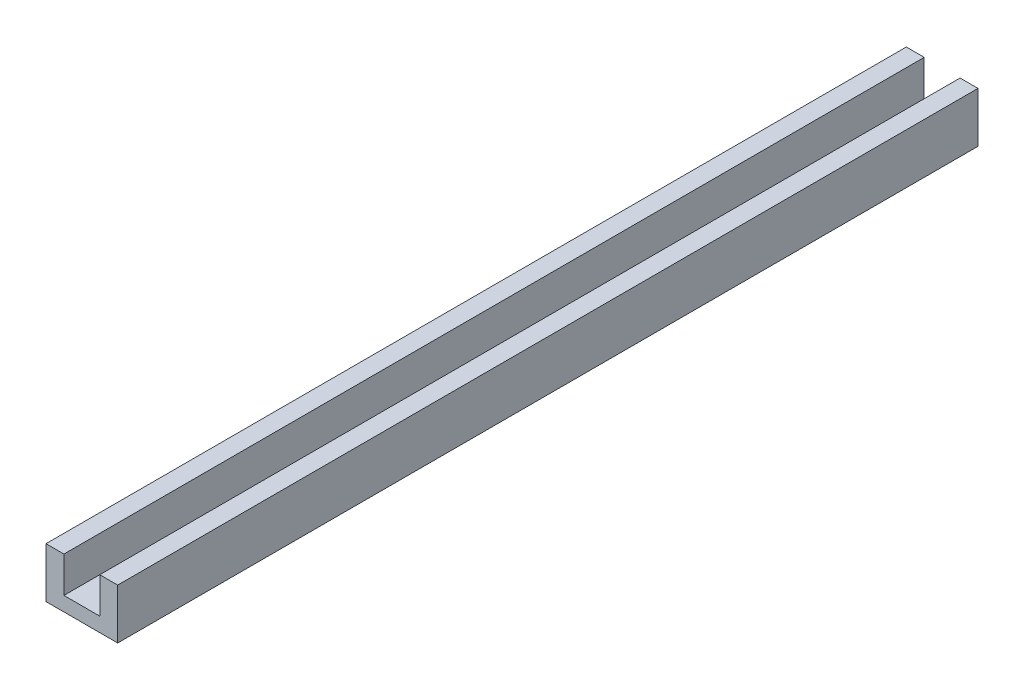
ISO-10303-21;
HEADER;
FILE_DESCRIPTION(('STEP AP214'),'2;1');
FILE_NAME('part.step','',(''),(''),'','','');
FILE_SCHEMA(('AUTOMOTIVE_DESIGN { 1 0 10303 214 1 1 1 1 }'));
ENDSEC;
DATA;
#1=APPLICATION_CONTEXT('core data for automotive mechanical design processes');
#2=APPLICATION_PROTOCOL_DEFINITION('international standard','automotive_design',2000,#1);
#3=PRODUCT_CONTEXT('',#1,'mechanical');
#4=PRODUCT('Part','Part','',(#3));
#5=PRODUCT_RELATED_PRODUCT_CATEGORY('part','',(#4));
#6=PRODUCT_DEFINITION_FORMATION('','',#4);
#7=PRODUCT_DEFINITION_CONTEXT('part definition',#1,'design');
#8=PRODUCT_DEFINITION('design','',#6,#7);
#9=PRODUCT_DEFINITION_SHAPE('','',#8);
#10=(LENGTH_UNIT() NAMED_UNIT(*) SI_UNIT(.MILLI.,.METRE.));
#11=(NAMED_UNIT(*) PLANE_ANGLE_UNIT() SI_UNIT($,.RADIAN.));
#12=(NAMED_UNIT(*) SI_UNIT($,.STERADIAN.) SOLID_ANGLE_UNIT());
#13=UNCERTAINTY_MEASURE_WITH_UNIT(LENGTH_MEASURE(1.E-05),#10,'distance_accuracy_value','');
#14=(GEOMETRIC_REPRESENTATION_CONTEXT(3) GLOBAL_UNCERTAINTY_ASSIGNED_CONTEXT((#13)) GLOBAL_UNIT_ASSIGNED_CONTEXT((#10,
#11,#12)) REPRESENTATION_CONTEXT('',''));
#15=CARTESIAN_POINT('',(0.,0.,0.));
#16=DIRECTION('',(0.,0.,1.));
#17=DIRECTION('',(1.,0.,0.));
#18=AXIS2_PLACEMENT_3D('',#15,#16,#17);
#19=CARTESIAN_POINT('',(25.4,0.,152.4));
#20=DIRECTION('',(0.,-1.,0.));
#21=DIRECTION('',(0.,0.,-1.));
#22=AXIS2_PLACEMENT_3D('',#19,#20,#21);
#23=PLANE('',#22);
#24=DIRECTION('',(-1.,0.,0.));
#25=VECTOR('',#24,1.);
#26=CARTESIAN_POINT('',(25.4,0.,-152.4));
#27=LINE('',#26,#25);
#28=CARTESIAN_POINT('',(25.4,0.,-152.4));
#29=VERTEX_POINT('',#28);
#30=CARTESIAN_POINT('',(0.,0.,-152.4));
#31=VERTEX_POINT('',#30);
#32=EDGE_CURVE('E134',#29,#31,#27,.T.);
#33=ORIENTED_EDGE('',*,*,#32,.F.);
#34=DIRECTION('',(0.,0.,-1.));
#35=VECTOR('',#34,1.);
#36=CARTESIAN_POINT('',(25.4,0.,152.4));
#37=LINE('',#36,#35);
#38=CARTESIAN_POINT('',(25.4,0.,152.4));
#39=VERTEX_POINT('',#38);
#40=EDGE_CURVE('E11',#39,#29,#37,.T.);
#41=ORIENTED_EDGE('',*,*,#40,.F.);
#42=DIRECTION('',(-1.,0.,0.));
#43=VECTOR('',#42,1.);
#44=CARTESIAN_POINT('',(25.4,0.,152.4));
#45=LINE('',#44,#43);
#46=CARTESIAN_POINT('',(0.,0.,152.4));
#47=VERTEX_POINT('',#46);
#48=EDGE_CURVE('E154',#39,#47,#45,.T.);
#49=ORIENTED_EDGE('',*,*,#48,.T.);
#50=DIRECTION('',(0.,0.,-1.));
#51=VECTOR('',#50,1.);
#52=CARTESIAN_POINT('',(0.,0.,152.4));
#53=LINE('',#52,#51);
#54=EDGE_CURVE('E40',#47,#31,#53,.T.);
#55=ORIENTED_EDGE('',*,*,#54,.T.);
#56=EDGE_LOOP('',(#33,#41,#49,#55));
#57=FACE_BOUND('',#56,.T.);
#58=ADVANCED_FACE('F37',(#57),#23,.T.);
#59=CARTESIAN_POINT('',(25.4,17.78,152.4));
#60=DIRECTION('',(1.,0.,0.));
#61=DIRECTION('',(0.,1.,0.));
#62=AXIS2_PLACEMENT_3D('',#59,#60,#61);
#63=PLANE('',#62);
#64=DIRECTION('',(0.,-1.,0.));
#65=VECTOR('',#64,1.);
#66=CARTESIAN_POINT('',(25.4,17.78,-152.4));
#67=LINE('',#66,#65);
#68=CARTESIAN_POINT('',(25.4,17.78,-152.4));
#69=VERTEX_POINT('',#68);
#70=EDGE_CURVE('E152',#69,#29,#67,.T.);
#71=ORIENTED_EDGE('',*,*,#70,.F.);
#72=DIRECTION('',(0.,0.,-1.));
#73=VECTOR('',#72,1.);
#74=CARTESIAN_POINT('',(25.4,17.78,152.4));
#75=LINE('',#74,#73);
#76=CARTESIAN_POINT('',(25.4,17.78,152.4));
#77=VERTEX_POINT('',#76);
#78=EDGE_CURVE('E46',#77,#69,#75,.T.);
#79=ORIENTED_EDGE('',*,*,#78,.F.);
#80=DIRECTION('',(0.,-1.,0.));
#81=VECTOR('',#80,1.);
#82=CARTESIAN_POINT('',(25.4,17.78,152.4));
#83=LINE('',#82,#81);
#84=EDGE_CURVE('E124',#77,#39,#83,.T.);
#85=ORIENTED_EDGE('',*,*,#84,.T.);
#86=ORIENTED_EDGE('',*,*,#40,.T.);
#87=EDGE_LOOP('',(#71,#79,#85,#86));
#88=FACE_BOUND('',#87,.T.);
#89=ADVANCED_FACE('F166',(#88),#63,.T.);
#90=CARTESIAN_POINT('',(19.05,17.78,152.4));
#91=DIRECTION('',(0.,1.,0.));
#92=DIRECTION('',(0.,0.,1.));
#93=AXIS2_PLACEMENT_3D('',#90,#91,#92);
#94=PLANE('',#93);
#95=DIRECTION('',(1.,0.,0.));
#96=VECTOR('',#95,1.);
#97=CARTESIAN_POINT('',(19.05,17.78,-152.4));
#98=LINE('',#97,#96);
#99=CARTESIAN_POINT('',(19.05,17.78,-152.4));
#100=VERTEX_POINT('',#99);
#101=EDGE_CURVE('E111',#100,#69,#98,.T.);
#102=ORIENTED_EDGE('',*,*,#101,.F.);
#103=DIRECTION('',(0.,0.,-1.));
#104=VECTOR('',#103,1.);
#105=CARTESIAN_POINT('',(19.05,17.78,152.4));
#106=LINE('',#105,#104);
#107=CARTESIAN_POINT('',(19.05,17.78,152.4));
#108=VERTEX_POINT('',#107);
#109=EDGE_CURVE('E106',#108,#100,#106,.T.);
#110=ORIENTED_EDGE('',*,*,#109,.F.);
#111=DIRECTION('',(1.,0.,0.));
#112=VECTOR('',#111,1.);
#113=CARTESIAN_POINT('',(19.05,17.78,152.4));
#114=LINE('',#113,#112);
#115=EDGE_CURVE('E109',#108,#77,#114,.T.);
#116=ORIENTED_EDGE('',*,*,#115,.T.);
#117=ORIENTED_EDGE('',*,*,#78,.T.);
#118=EDGE_LOOP('',(#102,#110,#116,#117));
#119=FACE_BOUND('',#118,.T.);
#120=ADVANCED_FACE('F108',(#119),#94,.T.);
#121=CARTESIAN_POINT('',(19.05,5.08,152.4));
#122=DIRECTION('',(-1.,0.,0.));
#123=DIRECTION('',(0.,0.,1.));
#124=AXIS2_PLACEMENT_3D('',#121,#122,#123);
#125=PLANE('',#124);
#126=DIRECTION('',(0.,1.,0.));
#127=VECTOR('',#126,1.);
#128=CARTESIAN_POINT('',(19.05,5.08,-152.4));
#129=LINE('',#128,#127);
#130=CARTESIAN_POINT('',(19.05,5.08,-152.4));
#131=VERTEX_POINT('',#130);
#132=EDGE_CURVE('E149',#131,#100,#129,.T.);
#133=ORIENTED_EDGE('',*,*,#132,.F.);
#134=DIRECTION('',(0.,0.,-1.));
#135=VECTOR('',#134,1.);
#136=CARTESIAN_POINT('',(19.05,5.08,152.4));
#137=LINE('',#136,#135);
#138=CARTESIAN_POINT('',(19.05,5.08,152.4));
#139=VERTEX_POINT('',#138);
#140=EDGE_CURVE('E116',#139,#131,#137,.T.);
#141=ORIENTED_EDGE('',*,*,#140,.F.);
#142=DIRECTION('',(0.,1.,0.));
#143=VECTOR('',#142,1.);
#144=CARTESIAN_POINT('',(19.05,5.08,152.4));
#145=LINE('',#144,#143);
#146=EDGE_CURVE('E122',#139,#108,#145,.T.);
#147=ORIENTED_EDGE('',*,*,#146,.T.);
#148=ORIENTED_EDGE('',*,*,#109,.T.);
#149=EDGE_LOOP('',(#133,#141,#147,#148));
#150=FACE_BOUND('',#149,.T.);
#151=ADVANCED_FACE('F126',(#150),#125,.T.);
#152=CARTESIAN_POINT('',(6.35000000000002,5.08,152.4));
#153=DIRECTION('',(0.,1.,0.));
#154=DIRECTION('',(0.,0.,1.));
#155=AXIS2_PLACEMENT_3D('',#152,#153,#154);
#156=PLANE('',#155);
#157=DIRECTION('',(1.,0.,0.));
#158=VECTOR('',#157,1.);
#159=CARTESIAN_POINT('',(6.35000000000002,5.08,-152.4));
#160=LINE('',#159,#158);
#161=CARTESIAN_POINT('',(6.35000000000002,5.08,-152.4));
#162=VERTEX_POINT('',#161);
#163=EDGE_CURVE('E146',#162,#131,#160,.T.);
#164=ORIENTED_EDGE('',*,*,#163,.F.);
#165=DIRECTION('',(0.,0.,-1.));
#166=VECTOR('',#165,1.);
#167=CARTESIAN_POINT('',(6.35000000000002,5.08,152.4));
#168=LINE('',#167,#166);
#169=CARTESIAN_POINT('',(6.35000000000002,5.08,152.4));
#170=VERTEX_POINT('',#169);
#171=EDGE_CURVE('E158',#170,#162,#168,.T.);
#172=ORIENTED_EDGE('',*,*,#171,.F.);
#173=DIRECTION('',(1.,0.,0.));
#174=VECTOR('',#173,1.);
#175=CARTESIAN_POINT('',(6.35000000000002,5.08,152.4));
#176=LINE('',#175,#174);
#177=EDGE_CURVE('E127',#170,#139,#176,.T.);
#178=ORIENTED_EDGE('',*,*,#177,.T.);
#179=ORIENTED_EDGE('',*,*,#140,.T.);
#180=EDGE_LOOP('',(#164,#172,#178,#179));
#181=FACE_BOUND('',#180,.T.);
#182=ADVANCED_FACE('F179',(#181),#156,.T.);
#183=CARTESIAN_POINT('',(6.35000000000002,17.78,152.4));
#184=DIRECTION('',(1.,0.,0.));
#185=DIRECTION('',(0.,1.,0.));
#186=AXIS2_PLACEMENT_3D('',#183,#184,#185);
#187=PLANE('',#186);
#188=DIRECTION('',(0.,-1.,0.));
#189=VECTOR('',#188,1.);
#190=CARTESIAN_POINT('',(6.35000000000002,17.78,-152.4));
#191=LINE('',#190,#189);
#192=CARTESIAN_POINT('',(6.35000000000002,17.78,-152.4));
#193=VERTEX_POINT('',#192);
#194=EDGE_CURVE('E143',#193,#162,#191,.T.);
#195=ORIENTED_EDGE('',*,*,#194,.F.);
#196=DIRECTION('',(0.,0.,-1.));
#197=VECTOR('',#196,1.);
#198=CARTESIAN_POINT('',(6.35000000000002,17.78,152.4));
#199=LINE('',#198,#197);
#200=CARTESIAN_POINT('',(6.35000000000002,17.78,152.4));
#201=VERTEX_POINT('',#200);
#202=EDGE_CURVE('E160',#201,#193,#199,.T.);
#203=ORIENTED_EDGE('',*,*,#202,.F.);
#204=DIRECTION('',(0.,-1.,0.));
#205=VECTOR('',#204,1.);
#206=CARTESIAN_POINT('',(6.35000000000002,17.78,152.4));
#207=LINE('',#206,#205);
#208=EDGE_CURVE('E129',#201,#170,#207,.T.);
#209=ORIENTED_EDGE('',*,*,#208,.T.);
#210=ORIENTED_EDGE('',*,*,#171,.T.);
#211=EDGE_LOOP('',(#195,#203,#209,#210));
#212=FACE_BOUND('',#211,.T.);
#213=ADVANCED_FACE('F182',(#212),#187,.T.);
#214=CARTESIAN_POINT('',(0.,17.78,152.4));
#215=DIRECTION('',(0.,1.,0.));
#216=DIRECTION('',(0.,0.,1.));
#217=AXIS2_PLACEMENT_3D('',#214,#215,#216);
#218=PLANE('',#217);
#219=DIRECTION('',(1.,0.,0.));
#220=VECTOR('',#219,1.);
#221=CARTESIAN_POINT('',(0.,17.78,-152.4));
#222=LINE('',#221,#220);
#223=CARTESIAN_POINT('',(0.,17.78,-152.4));
#224=VERTEX_POINT('',#223);
#225=EDGE_CURVE('E140',#224,#193,#222,.T.);
#226=ORIENTED_EDGE('',*,*,#225,.F.);
#227=DIRECTION('',(0.,0.,-1.));
#228=VECTOR('',#227,1.);
#229=CARTESIAN_POINT('',(0.,17.78,152.4));
#230=LINE('',#229,#228);
#231=CARTESIAN_POINT('',(0.,17.78,152.4));
#232=VERTEX_POINT('',#231);
#233=EDGE_CURVE('E161',#232,#224,#230,.T.);
#234=ORIENTED_EDGE('',*,*,#233,.F.);
#235=DIRECTION('',(1.,0.,0.));
#236=VECTOR('',#235,1.);
#237=CARTESIAN_POINT('',(0.,17.78,152.4));
#238=LINE('',#237,#236);
#239=EDGE_CURVE('E257',#232,#201,#238,.T.);
#240=ORIENTED_EDGE('',*,*,#239,.T.);
#241=ORIENTED_EDGE('',*,*,#202,.T.);
#242=EDGE_LOOP('',(#226,#234,#240,#241));
#243=FACE_BOUND('',#242,.T.);
#244=ADVANCED_FACE('F186',(#243),#218,.T.);
#245=CARTESIAN_POINT('',(0.,0.,152.4));
#246=DIRECTION('',(-1.,0.,0.));
#247=DIRECTION('',(0.,0.,1.));
#248=AXIS2_PLACEMENT_3D('',#245,#246,#247);
#249=PLANE('',#248);
#250=DIRECTION('',(0.,1.,0.));
#251=VECTOR('',#250,1.);
#252=CARTESIAN_POINT('',(0.,0.,-152.4));
#253=LINE('',#252,#251);
#254=EDGE_CURVE('E137',#31,#224,#253,.T.);
#255=ORIENTED_EDGE('',*,*,#254,.F.);
#256=ORIENTED_EDGE('',*,*,#54,.F.);
#257=DIRECTION('',(0.,1.,0.));
#258=VECTOR('',#257,1.);
#259=CARTESIAN_POINT('',(0.,0.,152.4));
#260=LINE('',#259,#258);
#261=EDGE_CURVE('E258',#47,#232,#260,.T.);
#262=ORIENTED_EDGE('',*,*,#261,.T.);
#263=ORIENTED_EDGE('',*,*,#233,.T.);
#264=EDGE_LOOP('',(#255,#256,#262,#263));
#265=FACE_BOUND('',#264,.T.);
#266=ADVANCED_FACE('F163',(#265),#249,.T.);
#267=CARTESIAN_POINT('',(0.,0.,152.4));
#268=DIRECTION('',(0.,0.,-1.));
#269=DIRECTION('',(-1.,0.,0.));
#270=AXIS2_PLACEMENT_3D('',#267,#268,#269);
#271=PLANE('',#270);
#272=ORIENTED_EDGE('',*,*,#48,.F.);
#273=ORIENTED_EDGE('',*,*,#84,.F.);
#274=ORIENTED_EDGE('',*,*,#115,.F.);
#275=ORIENTED_EDGE('',*,*,#146,.F.);
#276=ORIENTED_EDGE('',*,*,#177,.F.);
#277=ORIENTED_EDGE('',*,*,#208,.F.);
#278=ORIENTED_EDGE('',*,*,#239,.F.);
#279=ORIENTED_EDGE('',*,*,#261,.F.);
#280=EDGE_LOOP('',(#272,#273,#274,#275,#276,#277,#278,#279));
#281=FACE_BOUND('',#280,.T.);
#282=ADVANCED_FACE('F120',(#281),#271,.F.);
#283=CARTESIAN_POINT('',(0.,0.,-152.4));
#284=DIRECTION('',(0.,0.,-1.));
#285=DIRECTION('',(-1.,0.,0.));
#286=AXIS2_PLACEMENT_3D('',#283,#284,#285);
#287=PLANE('',#286);
#288=ORIENTED_EDGE('',*,*,#32,.T.);
#289=ORIENTED_EDGE('',*,*,#254,.T.);
#290=ORIENTED_EDGE('',*,*,#225,.T.);
#291=ORIENTED_EDGE('',*,*,#194,.T.);
#292=ORIENTED_EDGE('',*,*,#163,.T.);
#293=ORIENTED_EDGE('',*,*,#132,.T.);
#294=ORIENTED_EDGE('',*,*,#101,.T.);
#295=ORIENTED_EDGE('',*,*,#70,.T.);
#296=EDGE_LOOP('',(#288,#289,#290,#291,#292,#293,#294,#295));
#297=FACE_BOUND('',#296,.T.);
#298=ADVANCED_FACE('F165',(#297),#287,.T.);
#299=CLOSED_SHELL('',(#58,#89,#120,#151,#182,#213,#244,#266,#282,#298));
#300=MANIFOLD_SOLID_BREP('B2',#299);
#301=ADVANCED_BREP_SHAPE_REPRESENTATION('',(#18,#300),#14);
#302=SHAPE_DEFINITION_REPRESENTATION(#9,#301);
ENDSEC;
END-ISO-10303-21;
